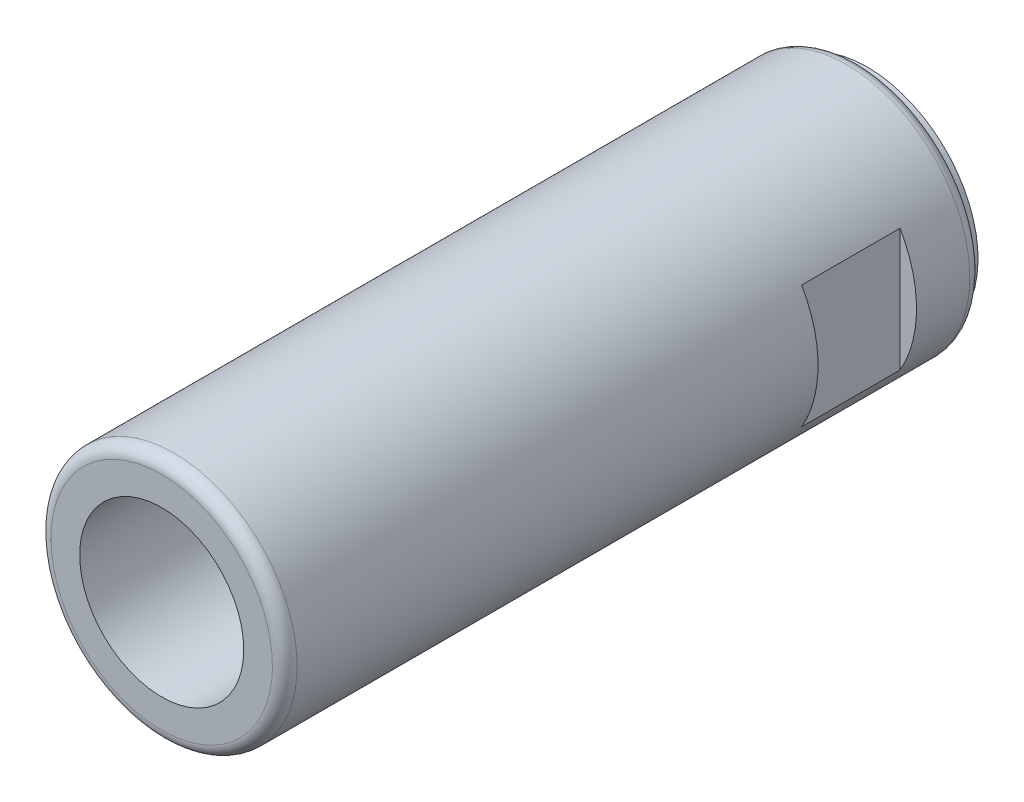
ISO-10303-21;
HEADER;
FILE_DESCRIPTION(('STEP AP214'),'2;1');
FILE_NAME('part.step','',(''),(''),'','','');
FILE_SCHEMA(('AUTOMOTIVE_DESIGN { 1 0 10303 214 1 1 1 1 }'));
ENDSEC;
DATA;
#1=APPLICATION_CONTEXT('core data for automotive mechanical design processes');
#2=APPLICATION_PROTOCOL_DEFINITION('international standard','automotive_design',2000,#1);
#3=PRODUCT_CONTEXT('',#1,'mechanical');
#4=PRODUCT('Part','Part','',(#3));
#5=PRODUCT_RELATED_PRODUCT_CATEGORY('part','',(#4));
#6=PRODUCT_DEFINITION_FORMATION('','',#4);
#7=PRODUCT_DEFINITION_CONTEXT('part definition',#1,'design');
#8=PRODUCT_DEFINITION('design','',#6,#7);
#9=PRODUCT_DEFINITION_SHAPE('','',#8);
#10=(LENGTH_UNIT() NAMED_UNIT(*) SI_UNIT(.MILLI.,.METRE.));
#11=(NAMED_UNIT(*) PLANE_ANGLE_UNIT() SI_UNIT($,.RADIAN.));
#12=(NAMED_UNIT(*) SI_UNIT($,.STERADIAN.) SOLID_ANGLE_UNIT());
#13=UNCERTAINTY_MEASURE_WITH_UNIT(LENGTH_MEASURE(1.E-05),#10,'distance_accuracy_value','');
#14=(GEOMETRIC_REPRESENTATION_CONTEXT(3) GLOBAL_UNCERTAINTY_ASSIGNED_CONTEXT((#13)) GLOBAL_UNIT_ASSIGNED_CONTEXT((#10,
#11,#12)) REPRESENTATION_CONTEXT('',''));
#15=CARTESIAN_POINT('',(0.,0.,0.));
#16=DIRECTION('',(0.,0.,1.));
#17=DIRECTION('',(1.,0.,0.));
#18=AXIS2_PLACEMENT_3D('',#15,#16,#17);
#19=CARTESIAN_POINT('',(0.,0.,0.));
#20=DIRECTION('',(0.,0.,1.));
#21=DIRECTION('',(0.,-1.,0.));
#22=AXIS2_PLACEMENT_3D('',#19,#20,#21);
#23=CYLINDRICAL_SURFACE('',#22,13.5);
#24=CARTESIAN_POINT('',(0.,0.,0.));
#25=DIRECTION('',(0.,0.,-1.));
#26=DIRECTION('',(0.,1.,0.));
#27=AXIS2_PLACEMENT_3D('',#24,#25,#26);
#28=CIRCLE('',#27,13.5);
#29=CARTESIAN_POINT('',(0.,13.5,0.));
#30=VERTEX_POINT('',#29);
#31=EDGE_CURVE('E92',#30,#30,#28,.T.);
#32=ORIENTED_EDGE('',*,*,#31,.F.);
#33=EDGE_LOOP('',(#32));
#34=FACE_BOUND('',#33,.T.);
#35=CARTESIAN_POINT('',(0.,0.,1.));
#36=DIRECTION('',(0.,0.,-1.));
#37=DIRECTION('',(0.,1.,0.));
#38=AXIS2_PLACEMENT_3D('',#35,#36,#37);
#39=CIRCLE('',#38,13.5);
#40=CARTESIAN_POINT('',(0.,13.5,1.));
#41=VERTEX_POINT('',#40);
#42=EDGE_CURVE('E78',#41,#41,#39,.T.);
#43=ORIENTED_EDGE('',*,*,#42,.T.);
#44=EDGE_LOOP('',(#43));
#45=FACE_BOUND('',#44,.T.);
#46=ADVANCED_FACE('F14',(#34,#45),#23,.T.);
#47=CARTESIAN_POINT('',(0.,0.,0.));
#48=DIRECTION('',(0.,0.,-1.));
#49=DIRECTION('',(0.,1.,0.));
#50=AXIS2_PLACEMENT_3D('',#47,#48,#49);
#51=PLANE('',#50);
#52=CARTESIAN_POINT('',(0.,0.,0.));
#53=DIRECTION('',(0.,0.,1.));
#54=DIRECTION('',(1.,0.,0.));
#55=AXIS2_PLACEMENT_3D('',#52,#53,#54);
#56=CIRCLE('',#55,10.);
#57=CARTESIAN_POINT('',(10.,0.,0.));
#58=VERTEX_POINT('',#57);
#59=EDGE_CURVE('E101',#58,#58,#56,.T.);
#60=ORIENTED_EDGE('',*,*,#59,.T.);
#61=EDGE_LOOP('',(#60));
#62=FACE_BOUND('',#61,.T.);
#63=ORIENTED_EDGE('',*,*,#31,.T.);
#64=EDGE_LOOP('',(#63));
#65=FACE_BOUND('',#64,.T.);
#66=ADVANCED_FACE('F105',(#62,#65),#51,.T.);
#67=CARTESIAN_POINT('',(13.5,0.,86.));
#68=DIRECTION('',(0.,0.,1.));
#69=DIRECTION('',(0.,-1.,0.));
#70=AXIS2_PLACEMENT_3D('',#67,#68,#69);
#71=PLANE('',#70);
#72=CARTESIAN_POINT('',(0.,0.,86.));
#73=DIRECTION('',(0.,0.,1.));
#74=DIRECTION('',(1.,0.,0.));
#75=AXIS2_PLACEMENT_3D('',#72,#73,#74);
#76=CIRCLE('',#75,10.);
#77=CARTESIAN_POINT('',(10.,0.,86.));
#78=VERTEX_POINT('',#77);
#79=EDGE_CURVE('E98',#78,#78,#76,.T.);
#80=ORIENTED_EDGE('',*,*,#79,.F.);
#81=EDGE_LOOP('',(#80));
#82=FACE_BOUND('',#81,.T.);
#83=CARTESIAN_POINT('',(0.,0.,86.));
#84=DIRECTION('',(0.,0.,-1.));
#85=DIRECTION('',(0.,1.,0.));
#86=AXIS2_PLACEMENT_3D('',#83,#84,#85);
#87=CIRCLE('',#86,13.5);
#88=CARTESIAN_POINT('',(0.,13.5,86.));
#89=VERTEX_POINT('',#88);
#90=EDGE_CURVE('E87',#89,#89,#87,.T.);
#91=ORIENTED_EDGE('',*,*,#90,.F.);
#92=EDGE_LOOP('',(#91));
#93=FACE_BOUND('',#92,.T.);
#94=ADVANCED_FACE('F16',(#82,#93),#71,.T.);
#95=CARTESIAN_POINT('',(0.,0.,9.));
#96=DIRECTION('',(0.,0.,1.));
#97=DIRECTION('',(0.,-1.,0.));
#98=AXIS2_PLACEMENT_3D('',#95,#96,#97);
#99=PLANE('',#98);
#100=DIRECTION('',(0.,-1.,0.));
#101=VECTOR('',#100,1.);
#102=CARTESIAN_POINT('',(-13.,30.,9.));
#103=LINE('',#102,#101);
#104=CARTESIAN_POINT('',(-13.,7.48331477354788,9.));
#105=VERTEX_POINT('',#104);
#106=CARTESIAN_POINT('',(-13.,-7.48331477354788,9.));
#107=VERTEX_POINT('',#106);
#108=EDGE_CURVE('E30',#105,#107,#103,.T.);
#109=ORIENTED_EDGE('',*,*,#108,.F.);
#110=CARTESIAN_POINT('',(0.,0.,9.));
#111=DIRECTION('',(0.,0.,1.));
#112=DIRECTION('',(0.,-1.,0.));
#113=AXIS2_PLACEMENT_3D('',#110,#111,#112);
#114=CIRCLE('',#113,15.);
#115=EDGE_CURVE('E54',#107,#105,#114,.F.);
#116=ORIENTED_EDGE('',*,*,#115,.F.);
#117=EDGE_LOOP('',(#109,#116));
#118=FACE_BOUND('',#117,.T.);
#119=ADVANCED_FACE('F55',(#118),#99,.T.);
#120=CARTESIAN_POINT('',(-13.,30.,21.));
#121=DIRECTION('',(1.,0.,0.));
#122=DIRECTION('',(0.,1.,0.));
#123=AXIS2_PLACEMENT_3D('',#120,#121,#122);
#124=PLANE('',#123);
#125=DIRECTION('',(0.,0.,-1.));
#126=VECTOR('',#125,1.);
#127=CARTESIAN_POINT('',(-13.,-7.48331477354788,1.));
#128=LINE('',#127,#126);
#129=CARTESIAN_POINT('',(-13.,-7.48331477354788,21.));
#130=VERTEX_POINT('',#129);
#131=EDGE_CURVE('E18',#107,#130,#128,.F.);
#132=ORIENTED_EDGE('',*,*,#131,.T.);
#133=DIRECTION('',(0.,-1.,0.));
#134=VECTOR('',#133,1.);
#135=CARTESIAN_POINT('',(-13.,30.,21.));
#136=LINE('',#135,#134);
#137=CARTESIAN_POINT('',(-13.,7.48331477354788,21.));
#138=VERTEX_POINT('',#137);
#139=EDGE_CURVE('E89',#138,#130,#136,.T.);
#140=ORIENTED_EDGE('',*,*,#139,.F.);
#141=DIRECTION('',(0.,0.,-1.));
#142=VECTOR('',#141,1.);
#143=CARTESIAN_POINT('',(-13.,7.48331477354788,1.));
#144=LINE('',#143,#142);
#145=EDGE_CURVE('E59',#138,#105,#144,.T.);
#146=ORIENTED_EDGE('',*,*,#145,.T.);
#147=ORIENTED_EDGE('',*,*,#108,.T.);
#148=EDGE_LOOP('',(#132,#140,#146,#147));
#149=FACE_BOUND('',#148,.T.);
#150=ADVANCED_FACE('F63',(#149),#124,.F.);
#151=CARTESIAN_POINT('',(0.,0.,21.));
#152=DIRECTION('',(0.,0.,1.));
#153=DIRECTION('',(0.,-1.,0.));
#154=AXIS2_PLACEMENT_3D('',#151,#152,#153);
#155=PLANE('',#154);
#156=CARTESIAN_POINT('',(0.,0.,21.));
#157=DIRECTION('',(0.,0.,1.));
#158=DIRECTION('',(0.,-1.,0.));
#159=AXIS2_PLACEMENT_3D('',#156,#157,#158);
#160=CIRCLE('',#159,15.);
#161=EDGE_CURVE('E9',#130,#138,#160,.F.);
#162=ORIENTED_EDGE('',*,*,#161,.T.);
#163=ORIENTED_EDGE('',*,*,#139,.T.);
#164=EDGE_LOOP('',(#162,#163));
#165=FACE_BOUND('',#164,.T.);
#166=ADVANCED_FACE('F134',(#165),#155,.F.);
#167=DIRECTION('',(0.,1.,0.));
#168=VECTOR('',#167,1.);
#169=CARTESIAN_POINT('',(13.,-30.,21.));
#170=LINE('',#169,#168);
#171=CARTESIAN_POINT('',(13.,-7.48331477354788,21.));
#172=VERTEX_POINT('',#171);
#173=CARTESIAN_POINT('',(13.,7.48331477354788,21.));
#174=VERTEX_POINT('',#173);
#175=EDGE_CURVE('E66',#172,#174,#170,.T.);
#176=ORIENTED_EDGE('',*,*,#175,.T.);
#177=EDGE_CURVE('E24',#174,#172,#160,.F.);
#178=ORIENTED_EDGE('',*,*,#177,.T.);
#179=EDGE_LOOP('',(#176,#178));
#180=FACE_BOUND('',#179,.T.);
#181=ADVANCED_FACE('F130',(#180),#155,.F.);
#182=DIRECTION('',(0.,1.,0.));
#183=VECTOR('',#182,1.);
#184=CARTESIAN_POINT('',(13.,-30.,9.));
#185=LINE('',#184,#183);
#186=CARTESIAN_POINT('',(13.,-7.48331477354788,9.));
#187=VERTEX_POINT('',#186);
#188=CARTESIAN_POINT('',(13.,7.48331477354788,9.));
#189=VERTEX_POINT('',#188);
#190=EDGE_CURVE('E37',#187,#189,#185,.T.);
#191=ORIENTED_EDGE('',*,*,#190,.F.);
#192=EDGE_CURVE('E61',#189,#187,#114,.F.);
#193=ORIENTED_EDGE('',*,*,#192,.F.);
#194=EDGE_LOOP('',(#191,#193));
#195=FACE_BOUND('',#194,.T.);
#196=ADVANCED_FACE('F133',(#195),#99,.T.);
#197=CARTESIAN_POINT('',(13.,-30.,21.));
#198=DIRECTION('',(-1.,0.,0.));
#199=DIRECTION('',(0.,-1.,0.));
#200=AXIS2_PLACEMENT_3D('',#197,#198,#199);
#201=PLANE('',#200);
#202=DIRECTION('',(0.,0.,-1.));
#203=VECTOR('',#202,1.);
#204=CARTESIAN_POINT('',(13.,7.48331477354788,1.));
#205=LINE('',#204,#203);
#206=EDGE_CURVE('E72',#189,#174,#205,.F.);
#207=ORIENTED_EDGE('',*,*,#206,.T.);
#208=ORIENTED_EDGE('',*,*,#175,.F.);
#209=DIRECTION('',(0.,0.,-1.));
#210=VECTOR('',#209,1.);
#211=CARTESIAN_POINT('',(13.,-7.48331477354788,1.));
#212=LINE('',#211,#210);
#213=EDGE_CURVE('E75',#172,#187,#212,.T.);
#214=ORIENTED_EDGE('',*,*,#213,.T.);
#215=ORIENTED_EDGE('',*,*,#190,.T.);
#216=EDGE_LOOP('',(#207,#208,#214,#215));
#217=FACE_BOUND('',#216,.T.);
#218=ADVANCED_FACE('F138',(#217),#201,.F.);
#219=CARTESIAN_POINT('',(0.,0.,84.5));
#220=DIRECTION('',(0.,0.,-1.));
#221=DIRECTION('',(0.,1.,0.));
#222=AXIS2_PLACEMENT_3D('',#219,#220,#221);
#223=TOROIDAL_SURFACE('',#222,13.5,1.49999999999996);
#224=ORIENTED_EDGE('',*,*,#90,.T.);
#225=EDGE_LOOP('',(#224));
#226=FACE_BOUND('',#225,.T.);
#227=CARTESIAN_POINT('',(0.,0.,84.5));
#228=DIRECTION('',(0.,0.,-1.));
#229=DIRECTION('',(0.,1.,0.));
#230=AXIS2_PLACEMENT_3D('',#227,#228,#229);
#231=CIRCLE('',#230,15.);
#232=CARTESIAN_POINT('',(0.,15.,84.5));
#233=VERTEX_POINT('',#232);
#234=EDGE_CURVE('E84',#233,#233,#231,.T.);
#235=ORIENTED_EDGE('',*,*,#234,.F.);
#236=EDGE_LOOP('',(#235));
#237=FACE_BOUND('',#236,.T.);
#238=ADVANCED_FACE('F143',(#226,#237),#223,.T.);
#239=CARTESIAN_POINT('',(0.,0.,1.));
#240=DIRECTION('',(0.,0.,-1.));
#241=DIRECTION('',(0.,1.,0.));
#242=AXIS2_PLACEMENT_3D('',#239,#240,#241);
#243=CYLINDRICAL_SURFACE('',#242,15.);
#244=ORIENTED_EDGE('',*,*,#234,.T.);
#245=EDGE_LOOP('',(#244));
#246=FACE_BOUND('',#245,.T.);
#247=ORIENTED_EDGE('',*,*,#206,.F.);
#248=ORIENTED_EDGE('',*,*,#192,.T.);
#249=ORIENTED_EDGE('',*,*,#213,.F.);
#250=ORIENTED_EDGE('',*,*,#177,.F.);
#251=EDGE_LOOP('',(#247,#248,#249,#250));
#252=FACE_BOUND('',#251,.T.);
#253=ORIENTED_EDGE('',*,*,#161,.F.);
#254=ORIENTED_EDGE('',*,*,#131,.F.);
#255=ORIENTED_EDGE('',*,*,#115,.T.);
#256=ORIENTED_EDGE('',*,*,#145,.F.);
#257=EDGE_LOOP('',(#253,#254,#255,#256));
#258=FACE_BOUND('',#257,.T.);
#259=CARTESIAN_POINT('',(0.,0.,2.5));
#260=DIRECTION('',(0.,0.,-1.));
#261=DIRECTION('',(0.,1.,0.));
#262=AXIS2_PLACEMENT_3D('',#259,#260,#261);
#263=CIRCLE('',#262,15.);
#264=CARTESIAN_POINT('',(0.,15.,2.5));
#265=VERTEX_POINT('',#264);
#266=EDGE_CURVE('E81',#265,#265,#263,.T.);
#267=ORIENTED_EDGE('',*,*,#266,.F.);
#268=EDGE_LOOP('',(#267));
#269=FACE_BOUND('',#268,.T.);
#270=ADVANCED_FACE('F69',(#246,#252,#258,#269),#243,.T.);
#271=CARTESIAN_POINT('',(0.,0.,2.5));
#272=DIRECTION('',(0.,0.,-1.));
#273=DIRECTION('',(0.,1.,0.));
#274=AXIS2_PLACEMENT_3D('',#271,#272,#273);
#275=TOROIDAL_SURFACE('',#274,13.5,1.5);
#276=ORIENTED_EDGE('',*,*,#266,.T.);
#277=EDGE_LOOP('',(#276));
#278=FACE_BOUND('',#277,.T.);
#279=ORIENTED_EDGE('',*,*,#42,.F.);
#280=EDGE_LOOP('',(#279));
#281=FACE_BOUND('',#280,.T.);
#282=ADVANCED_FACE('F110',(#278,#281),#275,.T.);
#283=CARTESIAN_POINT('',(0.,0.,0.));
#284=DIRECTION('',(0.,0.,1.));
#285=DIRECTION('',(1.,0.,0.));
#286=AXIS2_PLACEMENT_3D('',#283,#284,#285);
#287=CYLINDRICAL_SURFACE('',#286,10.);
#288=ORIENTED_EDGE('',*,*,#79,.T.);
#289=EDGE_LOOP('',(#288));
#290=FACE_BOUND('',#289,.T.);
#291=ORIENTED_EDGE('',*,*,#59,.F.);
#292=EDGE_LOOP('',(#291));
#293=FACE_BOUND('',#292,.T.);
#294=ADVANCED_FACE('F108',(#290,#293),#287,.F.);
#295=CLOSED_SHELL('',(#46,#66,#94,#119,#150,#166,#181,#196,#218,#238,#270,#282,#294));
#296=MANIFOLD_SOLID_BREP('B1',#295);
#297=ADVANCED_BREP_SHAPE_REPRESENTATION('',(#18,#296),#14);
#298=SHAPE_DEFINITION_REPRESENTATION(#9,#297);
ENDSEC;
END-ISO-10303-21;
